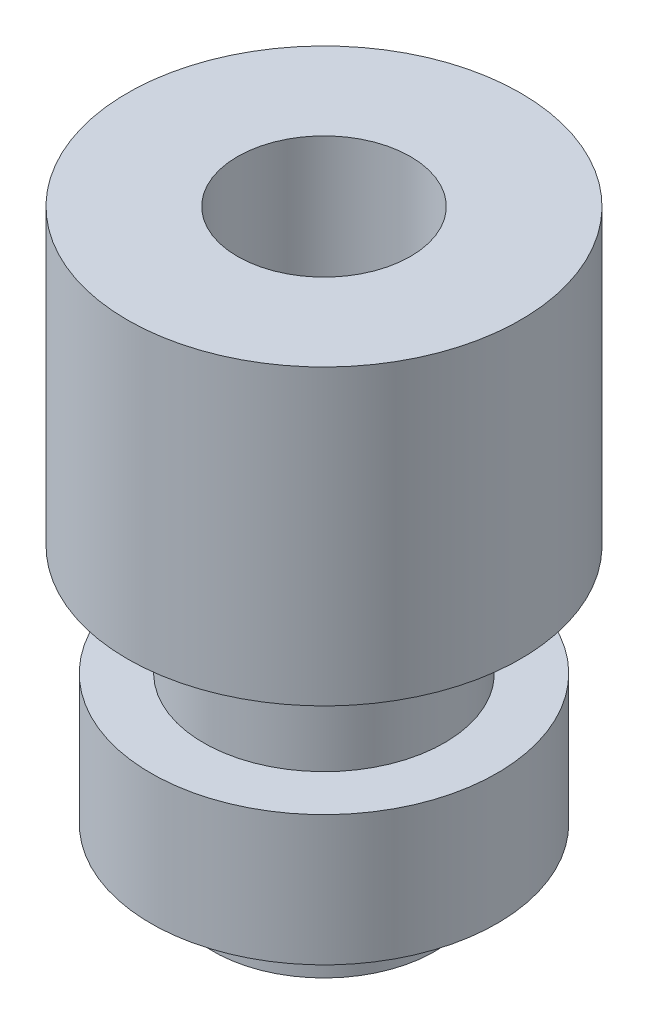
from build123d import *


with BuildPart() as part:
    # Sketch1 → Revolve1 (revolve)
    with BuildSketch(Plane.XY, mode=Mode.PRIVATE) as revolve1_sk:
        Polygon((-3.96875, 0), (-5.08, 0), (-5.08, 2.54), (-7.9375, 2.54), (-7.9375, 8.509), (-5.5245, 8.509), (-5.5245, 13.589), (-9.017, 13.589), (-9.017, 27.051), (-3.96875, 27.051), align=None)
    revolve(revolve1_sk.sketch.rotate(Axis((0, 0, 0), (0, 1, 0)), 270), axis=Axis((0, 0, 0), (0, 1, 0)))


solid = part.part
